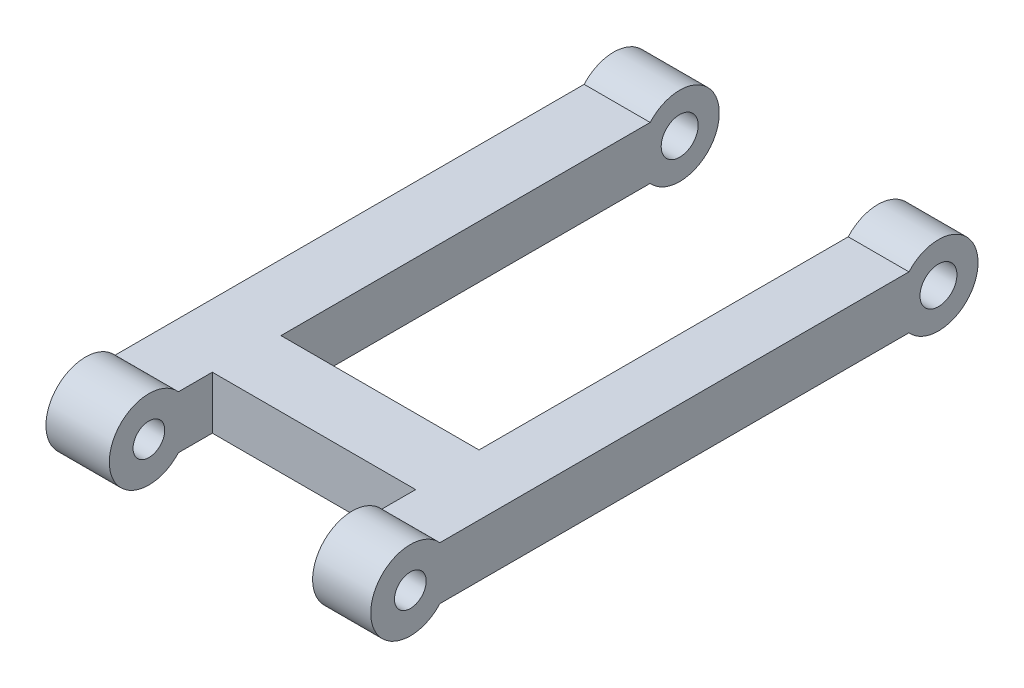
ISO-10303-21;
HEADER;
FILE_DESCRIPTION(('STEP AP214'),'2;1');
FILE_NAME('part.step','',(''),(''),'','','');
FILE_SCHEMA(('AUTOMOTIVE_DESIGN { 1 0 10303 214 1 1 1 1 }'));
ENDSEC;
DATA;
#1=APPLICATION_CONTEXT('core data for automotive mechanical design processes');
#2=APPLICATION_PROTOCOL_DEFINITION('international standard','automotive_design',2000,#1);
#3=PRODUCT_CONTEXT('',#1,'mechanical');
#4=PRODUCT('Part','Part','',(#3));
#5=PRODUCT_RELATED_PRODUCT_CATEGORY('part','',(#4));
#6=PRODUCT_DEFINITION_FORMATION('','',#4);
#7=PRODUCT_DEFINITION_CONTEXT('part definition',#1,'design');
#8=PRODUCT_DEFINITION('design','',#6,#7);
#9=PRODUCT_DEFINITION_SHAPE('','',#8);
#10=(LENGTH_UNIT() NAMED_UNIT(*) SI_UNIT(.MILLI.,.METRE.));
#11=(NAMED_UNIT(*) PLANE_ANGLE_UNIT() SI_UNIT($,.RADIAN.));
#12=(NAMED_UNIT(*) SI_UNIT($,.STERADIAN.) SOLID_ANGLE_UNIT());
#13=UNCERTAINTY_MEASURE_WITH_UNIT(LENGTH_MEASURE(1.E-05),#10,'distance_accuracy_value','');
#14=(GEOMETRIC_REPRESENTATION_CONTEXT(3) GLOBAL_UNCERTAINTY_ASSIGNED_CONTEXT((#13)) GLOBAL_UNIT_ASSIGNED_CONTEXT((#10,
#11,#12)) REPRESENTATION_CONTEXT('',''));
#15=CARTESIAN_POINT('',(0.,0.,0.));
#16=DIRECTION('',(0.,0.,1.));
#17=DIRECTION('',(1.,0.,0.));
#18=AXIS2_PLACEMENT_3D('',#15,#16,#17);
#19=CARTESIAN_POINT('',(0.,2.54,0.));
#20=DIRECTION('',(1.,0.,0.));
#21=DIRECTION('',(0.,0.,-1.));
#22=AXIS2_PLACEMENT_3D('',#19,#20,#21);
#23=CYLINDRICAL_SURFACE('',#22,3.81);
#24=CARTESIAN_POINT('',(6.096,2.54,0.));
#25=DIRECTION('',(-1.,0.,0.));
#26=DIRECTION('',(0.,0.,1.));
#27=AXIS2_PLACEMENT_3D('',#24,#25,#26);
#28=CIRCLE('',#27,3.81);
#29=CARTESIAN_POINT('',(6.096,5.08,-2.83980633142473));
#30=VERTEX_POINT('',#29);
#31=CARTESIAN_POINT('',(6.096,0.,-2.83980633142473));
#32=VERTEX_POINT('',#31);
#33=EDGE_CURVE('E192',#30,#32,#28,.F.);
#34=ORIENTED_EDGE('',*,*,#33,.F.);
#35=DIRECTION('',(1.,0.,0.));
#36=VECTOR('',#35,1.);
#37=CARTESIAN_POINT('',(0.,5.08,-2.83980633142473));
#38=LINE('',#37,#36);
#39=CARTESIAN_POINT('',(0.,5.08,-2.83980633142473));
#40=VERTEX_POINT('',#39);
#41=EDGE_CURVE('E175',#40,#30,#38,.T.);
#42=ORIENTED_EDGE('',*,*,#41,.F.);
#43=CARTESIAN_POINT('',(0.,2.54,0.));
#44=DIRECTION('',(1.,0.,0.));
#45=DIRECTION('',(0.,0.,-1.));
#46=AXIS2_PLACEMENT_3D('',#43,#44,#45);
#47=CIRCLE('',#46,3.81);
#48=CARTESIAN_POINT('',(0.,0.,-2.83980633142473));
#49=VERTEX_POINT('',#48);
#50=EDGE_CURVE('E170',#40,#49,#47,.T.);
#51=ORIENTED_EDGE('',*,*,#50,.T.);
#52=DIRECTION('',(1.,0.,0.));
#53=VECTOR('',#52,1.);
#54=CARTESIAN_POINT('',(0.,0.,-2.83980633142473));
#55=LINE('',#54,#53);
#56=EDGE_CURVE('E178',#32,#49,#55,.F.);
#57=ORIENTED_EDGE('',*,*,#56,.F.);
#58=EDGE_LOOP('',(#34,#42,#51,#57));
#59=FACE_BOUND('',#58,.T.);
#60=ADVANCED_FACE('F33',(#59),#23,.T.);
#61=CARTESIAN_POINT('',(0.,2.54,-50.8));
#62=DIRECTION('',(1.,0.,0.));
#63=DIRECTION('',(0.,0.,-1.));
#64=AXIS2_PLACEMENT_3D('',#61,#62,#63);
#65=CYLINDRICAL_SURFACE('',#64,3.81);
#66=CARTESIAN_POINT('',(25.4,2.54,-50.8));
#67=DIRECTION('',(1.,0.,0.));
#68=DIRECTION('',(0.,0.,-1.));
#69=AXIS2_PLACEMENT_3D('',#66,#67,#68);
#70=CIRCLE('',#69,3.81);
#71=CARTESIAN_POINT('',(25.4,5.08,-47.9601936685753));
#72=VERTEX_POINT('',#71);
#73=CARTESIAN_POINT('',(25.4,0.,-47.9601936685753));
#74=VERTEX_POINT('',#73);
#75=EDGE_CURVE('E133',#72,#74,#70,.F.);
#76=ORIENTED_EDGE('',*,*,#75,.F.);
#77=DIRECTION('',(1.,0.,0.));
#78=VECTOR('',#77,1.);
#79=CARTESIAN_POINT('',(0.,5.08,-47.9601936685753));
#80=LINE('',#79,#78);
#81=CARTESIAN_POINT('',(31.242,5.08,-47.9601936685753));
#82=VERTEX_POINT('',#81);
#83=EDGE_CURVE('E163',#82,#72,#80,.F.);
#84=ORIENTED_EDGE('',*,*,#83,.F.);
#85=CARTESIAN_POINT('',(31.242,2.54,-50.8));
#86=DIRECTION('',(1.,0.,0.));
#87=DIRECTION('',(0.,0.,-1.));
#88=AXIS2_PLACEMENT_3D('',#85,#86,#87);
#89=CIRCLE('',#88,3.81);
#90=CARTESIAN_POINT('',(31.242,0.,-47.9601936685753));
#91=VERTEX_POINT('',#90);
#92=EDGE_CURVE('E50',#91,#82,#89,.T.);
#93=ORIENTED_EDGE('',*,*,#92,.F.);
#94=DIRECTION('',(1.,0.,0.));
#95=VECTOR('',#94,1.);
#96=CARTESIAN_POINT('',(0.,0.,-47.9601936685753));
#97=LINE('',#96,#95);
#98=EDGE_CURVE('E166',#74,#91,#97,.T.);
#99=ORIENTED_EDGE('',*,*,#98,.F.);
#100=EDGE_LOOP('',(#76,#84,#93,#99));
#101=FACE_BOUND('',#100,.T.);
#102=ADVANCED_FACE('F253',(#101),#65,.T.);
#103=CARTESIAN_POINT('',(31.242,0.,0.));
#104=DIRECTION('',(0.,1.,0.));
#105=DIRECTION('',(0.,0.,1.));
#106=AXIS2_PLACEMENT_3D('',#103,#104,#105);
#107=PLANE('',#106);
#108=CARTESIAN_POINT('',(0.,0.,-47.9601936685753));
#109=VERTEX_POINT('',#108);
#110=CARTESIAN_POINT('',(6.35,0.,-47.9601936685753));
#111=VERTEX_POINT('',#110);
#112=EDGE_CURVE('E167',#109,#111,#97,.T.);
#113=ORIENTED_EDGE('',*,*,#112,.T.);
#114=DIRECTION('',(0.,0.,1.));
#115=VECTOR('',#114,1.);
#116=CARTESIAN_POINT('',(6.35000000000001,0.,0.));
#117=LINE('',#116,#115);
#118=CARTESIAN_POINT('',(6.35000000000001,0.,-12.4494363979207));
#119=VERTEX_POINT('',#118);
#120=EDGE_CURVE('E137',#111,#119,#117,.T.);
#121=ORIENTED_EDGE('',*,*,#120,.T.);
#122=DIRECTION('',(1.,0.,0.));
#123=VECTOR('',#122,1.);
#124=CARTESIAN_POINT('',(31.242,0.,-12.4494363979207));
#125=LINE('',#124,#123);
#126=CARTESIAN_POINT('',(25.4,0.,-12.4494363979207));
#127=VERTEX_POINT('',#126);
#128=EDGE_CURVE('E143',#119,#127,#125,.T.);
#129=ORIENTED_EDGE('',*,*,#128,.T.);
#130=DIRECTION('',(0.,0.,-1.));
#131=VECTOR('',#130,1.);
#132=CARTESIAN_POINT('',(25.4,0.,0.));
#133=LINE('',#132,#131);
#134=EDGE_CURVE('E127',#127,#74,#133,.T.);
#135=ORIENTED_EDGE('',*,*,#134,.T.);
#136=ORIENTED_EDGE('',*,*,#98,.T.);
#137=DIRECTION('',(0.,0.,-1.));
#138=VECTOR('',#137,1.);
#139=CARTESIAN_POINT('',(31.242,0.,0.));
#140=LINE('',#139,#138);
#141=CARTESIAN_POINT('',(31.242,0.,-2.83980633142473));
#142=VERTEX_POINT('',#141);
#143=EDGE_CURVE('E181',#142,#91,#140,.T.);
#144=ORIENTED_EDGE('',*,*,#143,.F.);
#145=CARTESIAN_POINT('',(25.654,0.,-2.83980633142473));
#146=VERTEX_POINT('',#145);
#147=EDGE_CURVE('E58',#142,#146,#55,.F.);
#148=ORIENTED_EDGE('',*,*,#147,.T.);
#149=DIRECTION('',(0.,0.,-1.));
#150=VECTOR('',#149,1.);
#151=CARTESIAN_POINT('',(25.654,0.,0.));
#152=LINE('',#151,#150);
#153=CARTESIAN_POINT('',(25.654,0.,-6.09943639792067));
#154=VERTEX_POINT('',#153);
#155=EDGE_CURVE('E239',#146,#154,#152,.T.);
#156=ORIENTED_EDGE('',*,*,#155,.T.);
#157=DIRECTION('',(-1.,0.,0.));
#158=VECTOR('',#157,1.);
#159=CARTESIAN_POINT('',(31.242,0.,-6.09943639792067));
#160=LINE('',#159,#158);
#161=CARTESIAN_POINT('',(6.096,0.,-6.09943639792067));
#162=VERTEX_POINT('',#161);
#163=EDGE_CURVE('E151',#154,#162,#160,.T.);
#164=ORIENTED_EDGE('',*,*,#163,.T.);
#165=DIRECTION('',(0.,0.,1.));
#166=VECTOR('',#165,1.);
#167=CARTESIAN_POINT('',(6.096,0.,0.));
#168=LINE('',#167,#166);
#169=EDGE_CURVE('E236',#162,#32,#168,.T.);
#170=ORIENTED_EDGE('',*,*,#169,.T.);
#171=ORIENTED_EDGE('',*,*,#56,.T.);
#172=DIRECTION('',(0.,0.,-1.));
#173=VECTOR('',#172,1.);
#174=CARTESIAN_POINT('',(0.,0.,0.));
#175=LINE('',#174,#173);
#176=EDGE_CURVE('E180',#49,#109,#175,.T.);
#177=ORIENTED_EDGE('',*,*,#176,.T.);
#178=EDGE_LOOP('',(#113,#121,#129,#135,#136,#144,#148,#156,#164,#170,#171,#177));
#179=FACE_BOUND('',#178,.T.);
#180=ADVANCED_FACE('F35',(#179),#107,.F.);
#181=CARTESIAN_POINT('',(31.242,5.08,0.));
#182=DIRECTION('',(0.,-1.,0.));
#183=DIRECTION('',(0.,0.,-1.));
#184=AXIS2_PLACEMENT_3D('',#181,#182,#183);
#185=PLANE('',#184);
#186=DIRECTION('',(-1.,0.,0.));
#187=VECTOR('',#186,1.);
#188=CARTESIAN_POINT('',(31.242,5.08,-12.4494363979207));
#189=LINE('',#188,#187);
#190=CARTESIAN_POINT('',(25.4,5.08,-12.4494363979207));
#191=VERTEX_POINT('',#190);
#192=CARTESIAN_POINT('',(6.35000000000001,5.08,-12.4494363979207));
#193=VERTEX_POINT('',#192);
#194=EDGE_CURVE('E11',#191,#193,#189,.T.);
#195=ORIENTED_EDGE('',*,*,#194,.T.);
#196=DIRECTION('',(0.,0.,-1.));
#197=VECTOR('',#196,1.);
#198=CARTESIAN_POINT('',(6.35000000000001,5.08,0.));
#199=LINE('',#198,#197);
#200=CARTESIAN_POINT('',(6.35,5.08,-47.9601936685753));
#201=VERTEX_POINT('',#200);
#202=EDGE_CURVE('E230',#193,#201,#199,.T.);
#203=ORIENTED_EDGE('',*,*,#202,.T.);
#204=CARTESIAN_POINT('',(0.,5.08,-47.9601936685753));
#205=VERTEX_POINT('',#204);
#206=EDGE_CURVE('E161',#201,#205,#80,.F.);
#207=ORIENTED_EDGE('',*,*,#206,.T.);
#208=DIRECTION('',(0.,0.,1.));
#209=VECTOR('',#208,1.);
#210=CARTESIAN_POINT('',(0.,5.08,0.));
#211=LINE('',#210,#209);
#212=EDGE_CURVE('E184',#205,#40,#211,.T.);
#213=ORIENTED_EDGE('',*,*,#212,.T.);
#214=ORIENTED_EDGE('',*,*,#41,.T.);
#215=DIRECTION('',(0.,0.,-1.));
#216=VECTOR('',#215,1.);
#217=CARTESIAN_POINT('',(6.096,5.08,0.));
#218=LINE('',#217,#216);
#219=CARTESIAN_POINT('',(6.096,5.08,-6.09943639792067));
#220=VERTEX_POINT('',#219);
#221=EDGE_CURVE('E233',#30,#220,#218,.T.);
#222=ORIENTED_EDGE('',*,*,#221,.T.);
#223=DIRECTION('',(1.,0.,0.));
#224=VECTOR('',#223,1.);
#225=CARTESIAN_POINT('',(31.242,5.08,-6.09943639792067));
#226=LINE('',#225,#224);
#227=CARTESIAN_POINT('',(25.654,5.08,-6.09943639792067));
#228=VERTEX_POINT('',#227);
#229=EDGE_CURVE('E42',#220,#228,#226,.T.);
#230=ORIENTED_EDGE('',*,*,#229,.T.);
#231=DIRECTION('',(0.,0.,1.));
#232=VECTOR('',#231,1.);
#233=CARTESIAN_POINT('',(25.654,5.08,0.));
#234=LINE('',#233,#232);
#235=CARTESIAN_POINT('',(25.654,5.08,-2.83980633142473));
#236=VERTEX_POINT('',#235);
#237=EDGE_CURVE('E156',#228,#236,#234,.T.);
#238=ORIENTED_EDGE('',*,*,#237,.T.);
#239=CARTESIAN_POINT('',(31.242,5.08,-2.83980633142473));
#240=VERTEX_POINT('',#239);
#241=EDGE_CURVE('E173',#236,#240,#38,.T.);
#242=ORIENTED_EDGE('',*,*,#241,.T.);
#243=DIRECTION('',(0.,0.,1.));
#244=VECTOR('',#243,1.);
#245=CARTESIAN_POINT('',(31.242,5.08,0.));
#246=LINE('',#245,#244);
#247=EDGE_CURVE('E183',#82,#240,#246,.T.);
#248=ORIENTED_EDGE('',*,*,#247,.F.);
#249=ORIENTED_EDGE('',*,*,#83,.T.);
#250=DIRECTION('',(0.,0.,1.));
#251=VECTOR('',#250,1.);
#252=CARTESIAN_POINT('',(25.4,5.08,0.));
#253=LINE('',#252,#251);
#254=EDGE_CURVE('E138',#72,#191,#253,.T.);
#255=ORIENTED_EDGE('',*,*,#254,.T.);
#256=EDGE_LOOP('',(#195,#203,#207,#213,#214,#222,#230,#238,#242,#248,#249,#255));
#257=FACE_BOUND('',#256,.T.);
#258=ADVANCED_FACE('F244',(#257),#185,.F.);
#259=CARTESIAN_POINT('',(31.242,0.,0.));
#260=DIRECTION('',(-1.,0.,0.));
#261=DIRECTION('',(0.,0.,1.));
#262=AXIS2_PLACEMENT_3D('',#259,#260,#261);
#263=PLANE('',#262);
#264=CARTESIAN_POINT('',(31.242,2.54,-50.8));
#265=DIRECTION('',(-1.,0.,0.));
#266=DIRECTION('',(0.,0.,1.));
#267=AXIS2_PLACEMENT_3D('',#264,#265,#266);
#268=CIRCLE('',#267,1.778);
#269=CARTESIAN_POINT('',(31.242,2.54,-49.022));
#270=VERTEX_POINT('',#269);
#271=EDGE_CURVE('E200',#270,#270,#268,.T.);
#272=ORIENTED_EDGE('',*,*,#271,.T.);
#273=EDGE_LOOP('',(#272));
#274=FACE_BOUND('',#273,.T.);
#275=CARTESIAN_POINT('',(31.242,2.54,0.));
#276=DIRECTION('',(-1.,0.,0.));
#277=DIRECTION('',(0.,0.,1.));
#278=AXIS2_PLACEMENT_3D('',#275,#276,#277);
#279=CIRCLE('',#278,1.524);
#280=CARTESIAN_POINT('',(31.242,2.54,1.524));
#281=VERTEX_POINT('',#280);
#282=EDGE_CURVE('E211',#281,#281,#279,.T.);
#283=ORIENTED_EDGE('',*,*,#282,.T.);
#284=EDGE_LOOP('',(#283));
#285=FACE_BOUND('',#284,.T.);
#286=ORIENTED_EDGE('',*,*,#143,.T.);
#287=ORIENTED_EDGE('',*,*,#92,.T.);
#288=ORIENTED_EDGE('',*,*,#247,.T.);
#289=CARTESIAN_POINT('',(31.242,2.54,0.));
#290=DIRECTION('',(1.,0.,0.));
#291=DIRECTION('',(0.,0.,-1.));
#292=AXIS2_PLACEMENT_3D('',#289,#290,#291);
#293=CIRCLE('',#292,3.81);
#294=EDGE_CURVE('E169',#240,#142,#293,.T.);
#295=ORIENTED_EDGE('',*,*,#294,.T.);
#296=EDGE_LOOP('',(#286,#287,#288,#295));
#297=FACE_BOUND('',#296,.T.);
#298=ADVANCED_FACE('F251',(#274,#285,#297),#263,.F.);
#299=CARTESIAN_POINT('',(0.,0.,0.));
#300=DIRECTION('',(-1.,0.,0.));
#301=DIRECTION('',(0.,0.,1.));
#302=AXIS2_PLACEMENT_3D('',#299,#300,#301);
#303=PLANE('',#302);
#304=CARTESIAN_POINT('',(0.,2.54,-50.8));
#305=DIRECTION('',(-1.,0.,0.));
#306=DIRECTION('',(0.,0.,1.));
#307=AXIS2_PLACEMENT_3D('',#304,#305,#306);
#308=CIRCLE('',#307,1.778);
#309=CARTESIAN_POINT('',(0.,2.54,-49.022));
#310=VERTEX_POINT('',#309);
#311=EDGE_CURVE('E206',#310,#310,#308,.T.);
#312=ORIENTED_EDGE('',*,*,#311,.F.);
#313=EDGE_LOOP('',(#312));
#314=FACE_BOUND('',#313,.T.);
#315=CARTESIAN_POINT('',(0.,2.54,0.));
#316=DIRECTION('',(-1.,0.,0.));
#317=DIRECTION('',(0.,0.,1.));
#318=AXIS2_PLACEMENT_3D('',#315,#316,#317);
#319=CIRCLE('',#318,1.524);
#320=CARTESIAN_POINT('',(0.,2.54,1.524));
#321=VERTEX_POINT('',#320);
#322=EDGE_CURVE('E216',#321,#321,#319,.T.);
#323=ORIENTED_EDGE('',*,*,#322,.F.);
#324=EDGE_LOOP('',(#323));
#325=FACE_BOUND('',#324,.T.);
#326=ORIENTED_EDGE('',*,*,#212,.F.);
#327=CARTESIAN_POINT('',(0.,2.54,-50.8));
#328=DIRECTION('',(1.,0.,0.));
#329=DIRECTION('',(0.,0.,-1.));
#330=AXIS2_PLACEMENT_3D('',#327,#328,#329);
#331=CIRCLE('',#330,3.81);
#332=EDGE_CURVE('E153',#109,#205,#331,.T.);
#333=ORIENTED_EDGE('',*,*,#332,.F.);
#334=ORIENTED_EDGE('',*,*,#176,.F.);
#335=ORIENTED_EDGE('',*,*,#50,.F.);
#336=EDGE_LOOP('',(#326,#333,#334,#335));
#337=FACE_BOUND('',#336,.T.);
#338=ADVANCED_FACE('F263',(#314,#325,#337),#303,.T.);
#339=CARTESIAN_POINT('',(25.654,2.54,0.));
#340=DIRECTION('',(1.,0.,0.));
#341=DIRECTION('',(0.,0.,-1.));
#342=AXIS2_PLACEMENT_3D('',#339,#340,#341);
#343=CIRCLE('',#342,3.81);
#344=EDGE_CURVE('E194',#146,#236,#343,.F.);
#345=ORIENTED_EDGE('',*,*,#344,.F.);
#346=ORIENTED_EDGE('',*,*,#147,.F.);
#347=ORIENTED_EDGE('',*,*,#294,.F.);
#348=ORIENTED_EDGE('',*,*,#241,.F.);
#349=EDGE_LOOP('',(#345,#346,#347,#348));
#350=FACE_BOUND('',#349,.T.);
#351=ADVANCED_FACE('F248',(#350),#23,.T.);
#352=CARTESIAN_POINT('',(6.35,2.54,-50.8));
#353=DIRECTION('',(-1.,0.,0.));
#354=DIRECTION('',(0.,0.,1.));
#355=AXIS2_PLACEMENT_3D('',#352,#353,#354);
#356=CIRCLE('',#355,3.81);
#357=EDGE_CURVE('E190',#111,#201,#356,.F.);
#358=ORIENTED_EDGE('',*,*,#357,.F.);
#359=ORIENTED_EDGE('',*,*,#112,.F.);
#360=ORIENTED_EDGE('',*,*,#332,.T.);
#361=ORIENTED_EDGE('',*,*,#206,.F.);
#362=EDGE_LOOP('',(#358,#359,#360,#361));
#363=FACE_BOUND('',#362,.T.);
#364=ADVANCED_FACE('F257',(#363),#65,.T.);
#365=CARTESIAN_POINT('',(25.4,-1.27,-12.4494363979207));
#366=DIRECTION('',(0.,0.,1.));
#367=DIRECTION('',(1.,0.,0.));
#368=AXIS2_PLACEMENT_3D('',#365,#366,#367);
#369=PLANE('',#368);
#370=DIRECTION('',(0.,1.,0.));
#371=VECTOR('',#370,1.);
#372=CARTESIAN_POINT('',(6.35000000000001,-1.27,-12.4494363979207));
#373=LINE('',#372,#371);
#374=EDGE_CURVE('E145',#119,#193,#373,.T.);
#375=ORIENTED_EDGE('',*,*,#374,.T.);
#376=ORIENTED_EDGE('',*,*,#194,.F.);
#377=DIRECTION('',(0.,1.,0.));
#378=VECTOR('',#377,1.);
#379=CARTESIAN_POINT('',(25.4,-1.27,-12.4494363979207));
#380=LINE('',#379,#378);
#381=EDGE_CURVE('E131',#127,#191,#380,.T.);
#382=ORIENTED_EDGE('',*,*,#381,.F.);
#383=ORIENTED_EDGE('',*,*,#128,.F.);
#384=EDGE_LOOP('',(#375,#376,#382,#383));
#385=FACE_BOUND('',#384,.T.);
#386=ADVANCED_FACE('F142',(#385),#369,.F.);
#387=CARTESIAN_POINT('',(6.35000000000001,-1.27,-12.4494363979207));
#388=DIRECTION('',(-1.,0.,0.));
#389=DIRECTION('',(0.,0.,1.));
#390=AXIS2_PLACEMENT_3D('',#387,#388,#389);
#391=PLANE('',#390);
#392=CARTESIAN_POINT('',(6.34999999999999,2.54,-50.8));
#393=DIRECTION('',(-1.,0.,0.));
#394=DIRECTION('',(0.,0.,1.));
#395=AXIS2_PLACEMENT_3D('',#392,#393,#394);
#396=CIRCLE('',#395,1.778);
#397=CARTESIAN_POINT('',(6.35,2.54,-49.022));
#398=VERTEX_POINT('',#397);
#399=EDGE_CURVE('E219',#398,#398,#396,.T.);
#400=ORIENTED_EDGE('',*,*,#399,.T.);
#401=EDGE_LOOP('',(#400));
#402=FACE_BOUND('',#401,.T.);
#403=ORIENTED_EDGE('',*,*,#374,.F.);
#404=ORIENTED_EDGE('',*,*,#120,.F.);
#405=ORIENTED_EDGE('',*,*,#357,.T.);
#406=ORIENTED_EDGE('',*,*,#202,.F.);
#407=EDGE_LOOP('',(#403,#404,#405,#406));
#408=FACE_BOUND('',#407,.T.);
#409=ADVANCED_FACE('F328',(#402,#408),#391,.F.);
#410=CARTESIAN_POINT('',(25.4,-1.27,-57.9100704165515));
#411=DIRECTION('',(1.,0.,0.));
#412=DIRECTION('',(0.,0.,-1.));
#413=AXIS2_PLACEMENT_3D('',#410,#411,#412);
#414=PLANE('',#413);
#415=CARTESIAN_POINT('',(25.4,2.54,-50.8));
#416=DIRECTION('',(1.,0.,0.));
#417=DIRECTION('',(0.,0.,-1.));
#418=AXIS2_PLACEMENT_3D('',#415,#416,#417);
#419=CIRCLE('',#418,1.778);
#420=CARTESIAN_POINT('',(25.4,2.54,-49.022));
#421=VERTEX_POINT('',#420);
#422=EDGE_CURVE('E37',#421,#421,#419,.T.);
#423=ORIENTED_EDGE('',*,*,#422,.T.);
#424=EDGE_LOOP('',(#423));
#425=FACE_BOUND('',#424,.T.);
#426=ORIENTED_EDGE('',*,*,#381,.T.);
#427=ORIENTED_EDGE('',*,*,#254,.F.);
#428=ORIENTED_EDGE('',*,*,#75,.T.);
#429=ORIENTED_EDGE('',*,*,#134,.F.);
#430=EDGE_LOOP('',(#426,#427,#428,#429));
#431=FACE_BOUND('',#430,.T.);
#432=ADVANCED_FACE('F129',(#425,#431),#414,.F.);
#433=CARTESIAN_POINT('',(6.096,-1.27,-6.09943639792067));
#434=DIRECTION('',(0.,0.,-1.));
#435=DIRECTION('',(-1.,0.,0.));
#436=AXIS2_PLACEMENT_3D('',#433,#434,#435);
#437=PLANE('',#436);
#438=DIRECTION('',(0.,1.,0.));
#439=VECTOR('',#438,1.);
#440=CARTESIAN_POINT('',(25.654,-1.27,-6.09943639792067));
#441=LINE('',#440,#439);
#442=EDGE_CURVE('E222',#154,#228,#441,.T.);
#443=ORIENTED_EDGE('',*,*,#442,.T.);
#444=ORIENTED_EDGE('',*,*,#229,.F.);
#445=DIRECTION('',(0.,1.,0.));
#446=VECTOR('',#445,1.);
#447=CARTESIAN_POINT('',(6.096,-1.27,-6.09943639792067));
#448=LINE('',#447,#446);
#449=EDGE_CURVE('E146',#162,#220,#448,.T.);
#450=ORIENTED_EDGE('',*,*,#449,.F.);
#451=ORIENTED_EDGE('',*,*,#163,.F.);
#452=EDGE_LOOP('',(#443,#444,#450,#451));
#453=FACE_BOUND('',#452,.T.);
#454=ADVANCED_FACE('F272',(#453),#437,.F.);
#455=CARTESIAN_POINT('',(25.654,-1.27,-6.09943639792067));
#456=DIRECTION('',(1.,0.,0.));
#457=DIRECTION('',(0.,0.,-1.));
#458=AXIS2_PLACEMENT_3D('',#455,#456,#457);
#459=PLANE('',#458);
#460=CARTESIAN_POINT('',(25.654,2.54,0.));
#461=DIRECTION('',(1.,0.,0.));
#462=DIRECTION('',(0.,0.,-1.));
#463=AXIS2_PLACEMENT_3D('',#460,#461,#462);
#464=CIRCLE('',#463,1.524);
#465=CARTESIAN_POINT('',(25.654,2.54,1.524));
#466=VERTEX_POINT('',#465);
#467=EDGE_CURVE('E199',#466,#466,#464,.T.);
#468=ORIENTED_EDGE('',*,*,#467,.T.);
#469=EDGE_LOOP('',(#468));
#470=FACE_BOUND('',#469,.T.);
#471=ORIENTED_EDGE('',*,*,#442,.F.);
#472=ORIENTED_EDGE('',*,*,#155,.F.);
#473=ORIENTED_EDGE('',*,*,#344,.T.);
#474=ORIENTED_EDGE('',*,*,#237,.F.);
#475=EDGE_LOOP('',(#471,#472,#473,#474));
#476=FACE_BOUND('',#475,.T.);
#477=ADVANCED_FACE('F273',(#470,#476),#459,.F.);
#478=CARTESIAN_POINT('',(6.096,-1.27,-6.09943639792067));
#479=DIRECTION('',(-1.,0.,0.));
#480=DIRECTION('',(0.,0.,1.));
#481=AXIS2_PLACEMENT_3D('',#478,#479,#480);
#482=PLANE('',#481);
#483=CARTESIAN_POINT('',(6.096,2.54,0.));
#484=DIRECTION('',(-1.,0.,0.));
#485=DIRECTION('',(0.,0.,1.));
#486=AXIS2_PLACEMENT_3D('',#483,#484,#485);
#487=CIRCLE('',#486,1.524);
#488=CARTESIAN_POINT('',(6.096,2.54,1.524));
#489=VERTEX_POINT('',#488);
#490=EDGE_CURVE('E197',#489,#489,#487,.T.);
#491=ORIENTED_EDGE('',*,*,#490,.T.);
#492=EDGE_LOOP('',(#491));
#493=FACE_BOUND('',#492,.T.);
#494=ORIENTED_EDGE('',*,*,#449,.T.);
#495=ORIENTED_EDGE('',*,*,#221,.F.);
#496=ORIENTED_EDGE('',*,*,#33,.T.);
#497=ORIENTED_EDGE('',*,*,#169,.F.);
#498=EDGE_LOOP('',(#494,#495,#496,#497));
#499=FACE_BOUND('',#498,.T.);
#500=ADVANCED_FACE('F269',(#493,#499),#482,.F.);
#501=CARTESIAN_POINT('',(31.242,2.54,0.));
#502=DIRECTION('',(-1.,0.,0.));
#503=DIRECTION('',(0.,0.,1.));
#504=AXIS2_PLACEMENT_3D('',#501,#502,#503);
#505=CYLINDRICAL_SURFACE('',#504,1.524);
#506=CARTESIAN_POINT('',(0.,2.54,1.524));
#507=CARTESIAN_POINT('',(0.0635000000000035,2.54,1.524));
#508=CARTESIAN_POINT('',(0.127000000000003,2.54,1.524));
#509=CARTESIAN_POINT('',(0.254000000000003,2.54,1.524));
#510=CARTESIAN_POINT('',(0.317500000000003,2.54,1.524));
#511=CARTESIAN_POINT('',(0.444500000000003,2.54,1.524));
#512=CARTESIAN_POINT('',(0.508000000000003,2.54,1.524));
#513=CARTESIAN_POINT('',(0.635000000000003,2.54,1.524));
#514=CARTESIAN_POINT('',(0.698500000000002,2.54,1.524));
#515=CARTESIAN_POINT('',(0.825500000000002,2.54,1.524));
#516=CARTESIAN_POINT('',(0.889000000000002,2.54,1.524));
#517=CARTESIAN_POINT('',(1.016,2.54,1.524));
#518=CARTESIAN_POINT('',(1.0795,2.54,1.524));
#519=CARTESIAN_POINT('',(1.2065,2.54,1.524));
#520=CARTESIAN_POINT('',(1.27,2.54,1.524));
#521=CARTESIAN_POINT('',(1.397,2.54,1.524));
#522=CARTESIAN_POINT('',(1.4605,2.54,1.524));
#523=CARTESIAN_POINT('',(1.5875,2.54,1.524));
#524=CARTESIAN_POINT('',(1.651,2.54,1.524));
#525=CARTESIAN_POINT('',(1.778,2.54,1.524));
#526=CARTESIAN_POINT('',(1.8415,2.54,1.524));
#527=CARTESIAN_POINT('',(1.9685,2.54,1.524));
#528=CARTESIAN_POINT('',(2.032,2.54,1.524));
#529=CARTESIAN_POINT('',(2.159,2.54,1.524));
#530=CARTESIAN_POINT('',(2.2225,2.54,1.524));
#531=CARTESIAN_POINT('',(2.3495,2.54,1.524));
#532=CARTESIAN_POINT('',(2.413,2.54,1.524));
#533=CARTESIAN_POINT('',(2.54,2.54,1.524));
#534=CARTESIAN_POINT('',(2.6035,2.54,1.524));
#535=CARTESIAN_POINT('',(2.7305,2.54,1.524));
#536=CARTESIAN_POINT('',(2.794,2.54,1.524));
#537=CARTESIAN_POINT('',(2.921,2.54,1.524));
#538=CARTESIAN_POINT('',(2.9845,2.54,1.524));
#539=CARTESIAN_POINT('',(3.1115,2.54,1.524));
#540=CARTESIAN_POINT('',(3.175,2.54,1.524));
#541=CARTESIAN_POINT('',(3.302,2.54,1.524));
#542=CARTESIAN_POINT('',(3.3655,2.54,1.524));
#543=CARTESIAN_POINT('',(3.4925,2.54,1.524));
#544=CARTESIAN_POINT('',(3.556,2.54,1.524));
#545=CARTESIAN_POINT('',(3.683,2.54,1.524));
#546=CARTESIAN_POINT('',(3.7465,2.54,1.524));
#547=CARTESIAN_POINT('',(3.8735,2.54,1.524));
#548=CARTESIAN_POINT('',(3.937,2.54,1.524));
#549=CARTESIAN_POINT('',(4.064,2.54,1.524));
#550=CARTESIAN_POINT('',(4.1275,2.54,1.524));
#551=CARTESIAN_POINT('',(4.2545,2.54,1.524));
#552=CARTESIAN_POINT('',(4.318,2.54,1.524));
#553=CARTESIAN_POINT('',(4.445,2.54,1.524));
#554=CARTESIAN_POINT('',(4.5085,2.54,1.524));
#555=CARTESIAN_POINT('',(4.6355,2.54,1.524));
#556=CARTESIAN_POINT('',(4.699,2.54,1.524));
#557=CARTESIAN_POINT('',(4.826,2.54,1.524));
#558=CARTESIAN_POINT('',(4.8895,2.54,1.524));
#559=CARTESIAN_POINT('',(5.0165,2.54,1.524));
#560=CARTESIAN_POINT('',(5.08,2.54,1.524));
#561=CARTESIAN_POINT('',(5.207,2.54,1.524));
#562=CARTESIAN_POINT('',(5.2705,2.54,1.524));
#563=CARTESIAN_POINT('',(5.3975,2.54,1.524));
#564=CARTESIAN_POINT('',(5.461,2.54,1.524));
#565=CARTESIAN_POINT('',(5.588,2.54,1.524));
#566=CARTESIAN_POINT('',(5.6515,2.54,1.524));
#567=CARTESIAN_POINT('',(5.7785,2.54,1.524));
#568=CARTESIAN_POINT('',(5.842,2.54,1.524));
#569=CARTESIAN_POINT('',(5.969,2.54,1.524));
#570=CARTESIAN_POINT('',(6.0325,2.54,1.524));
#571=CARTESIAN_POINT('',(6.096,2.54,1.524));
#572=B_SPLINE_CURVE_WITH_KNOTS('',3,(#506,#507,#508,#509,#510,#511,#512,#513,#514,#515,#516,
#517,#518,#519,#520,#521,#522,#523,#524,#525,#526,#527,#528,#529,#530,#531,#532,#533,#534,#535,
#536,#537,#538,#539,#540,#541,#542,#543,#544,#545,#546,#547,#548,#549,#550,#551,#552,#553,#554,
#555,#556,#557,#558,#559,#560,#561,#562,#563,#564,#565,#566,#567,#568,#569,#570,#571),
.UNSPECIFIED.,.F.,.F.,(4,2,2,2,2,2,2,2,2,2,2,2,2,2,2,2,2,2,2,2,2,2,2,2,2,2,2,2,2,2,2,2,4),(0.,
0.1905,0.380999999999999,0.571499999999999,0.761999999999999,0.952499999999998,1.143,1.3335,
1.524,1.7145,1.905,2.0955,2.286,2.4765,2.667,2.8575,3.048,3.2385,3.429,3.6195,3.81,4.0005,4.191,
4.3815,4.572,4.7625,4.953,5.1435,5.334,5.5245,5.715,5.9055,6.096),.UNSPECIFIED.);
#573=EDGE_CURVE('BSEAM281',#321,#489,#572,.T.);
#574=ORIENTED_EDGE('',*,*,#322,.T.);
#575=ORIENTED_EDGE('',*,*,#490,.F.);
#576=ORIENTED_EDGE('',*,*,#573,.T.);
#577=ORIENTED_EDGE('',*,*,#573,.F.);
#578=EDGE_LOOP('',(#574,#576,#575,#577));
#579=FACE_BOUND('',#578,.T.);
#580=ADVANCED_FACE('F281',(#579),#505,.F.);
#581=CARTESIAN_POINT('',(31.242,2.54,1.524));
#582=CARTESIAN_POINT('',(31.1837916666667,2.54,1.524));
#583=CARTESIAN_POINT('',(31.1255833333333,2.54,1.524));
#584=CARTESIAN_POINT('',(31.0091666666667,2.54,1.524));
#585=CARTESIAN_POINT('',(30.9509583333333,2.54,1.524));
#586=CARTESIAN_POINT('',(30.8345416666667,2.54,1.524));
#587=CARTESIAN_POINT('',(30.7763333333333,2.54,1.524));
#588=CARTESIAN_POINT('',(30.6599166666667,2.54,1.524));
#589=CARTESIAN_POINT('',(30.6017083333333,2.54,1.524));
#590=CARTESIAN_POINT('',(30.4852916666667,2.54,1.524));
#591=CARTESIAN_POINT('',(30.4270833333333,2.54,1.524));
#592=CARTESIAN_POINT('',(30.3106666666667,2.54,1.524));
#593=CARTESIAN_POINT('',(30.2524583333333,2.54,1.524));
#594=CARTESIAN_POINT('',(30.1360416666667,2.54,1.524));
#595=CARTESIAN_POINT('',(30.0778333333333,2.54,1.524));
#596=CARTESIAN_POINT('',(29.9614166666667,2.54,1.524));
#597=CARTESIAN_POINT('',(29.9032083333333,2.54,1.524));
#598=CARTESIAN_POINT('',(29.7867916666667,2.54,1.524));
#599=CARTESIAN_POINT('',(29.7285833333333,2.54,1.524));
#600=CARTESIAN_POINT('',(29.6121666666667,2.54,1.524));
#601=CARTESIAN_POINT('',(29.5539583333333,2.54,1.524));
#602=CARTESIAN_POINT('',(29.4375416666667,2.54,1.524));
#603=CARTESIAN_POINT('',(29.3793333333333,2.54,1.524));
#604=CARTESIAN_POINT('',(29.2629166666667,2.54,1.524));
#605=CARTESIAN_POINT('',(29.2047083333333,2.54,1.524));
#606=CARTESIAN_POINT('',(29.0882916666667,2.54,1.524));
#607=CARTESIAN_POINT('',(29.0300833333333,2.54,1.524));
#608=CARTESIAN_POINT('',(28.9136666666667,2.54,1.524));
#609=CARTESIAN_POINT('',(28.8554583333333,2.54,1.524));
#610=CARTESIAN_POINT('',(28.7390416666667,2.54,1.524));
#611=CARTESIAN_POINT('',(28.6808333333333,2.54,1.524));
#612=CARTESIAN_POINT('',(28.5644166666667,2.54,1.524));
#613=CARTESIAN_POINT('',(28.5062083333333,2.54,1.524));
#614=CARTESIAN_POINT('',(28.3897916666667,2.54,1.524));
#615=CARTESIAN_POINT('',(28.3315833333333,2.54,1.524));
#616=CARTESIAN_POINT('',(28.2151666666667,2.54,1.524));
#617=CARTESIAN_POINT('',(28.1569583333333,2.54,1.524));
#618=CARTESIAN_POINT('',(28.0405416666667,2.54,1.524));
#619=CARTESIAN_POINT('',(27.9823333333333,2.54,1.524));
#620=CARTESIAN_POINT('',(27.8659166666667,2.54,1.524));
#621=CARTESIAN_POINT('',(27.8077083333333,2.54,1.524));
#622=CARTESIAN_POINT('',(27.6912916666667,2.54,1.524));
#623=CARTESIAN_POINT('',(27.6330833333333,2.54,1.524));
#624=CARTESIAN_POINT('',(27.5166666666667,2.54,1.524));
#625=CARTESIAN_POINT('',(27.4584583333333,2.54,1.524));
#626=CARTESIAN_POINT('',(27.3420416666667,2.54,1.524));
#627=CARTESIAN_POINT('',(27.2838333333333,2.54,1.524));
#628=CARTESIAN_POINT('',(27.1674166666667,2.54,1.524));
#629=CARTESIAN_POINT('',(27.1092083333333,2.54,1.524));
#630=CARTESIAN_POINT('',(26.9927916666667,2.54,1.524));
#631=CARTESIAN_POINT('',(26.9345833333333,2.54,1.524));
#632=CARTESIAN_POINT('',(26.8181666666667,2.54,1.524));
#633=CARTESIAN_POINT('',(26.7599583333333,2.54,1.524));
#634=CARTESIAN_POINT('',(26.6435416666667,2.54,1.524));
#635=CARTESIAN_POINT('',(26.5853333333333,2.54,1.524));
#636=CARTESIAN_POINT('',(26.4689166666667,2.54,1.524));
#637=CARTESIAN_POINT('',(26.4107083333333,2.54,1.524));
#638=CARTESIAN_POINT('',(26.2942916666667,2.54,1.524));
#639=CARTESIAN_POINT('',(26.2360833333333,2.54,1.524));
#640=CARTESIAN_POINT('',(26.1196666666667,2.54,1.524));
#641=CARTESIAN_POINT('',(26.0614583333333,2.54,1.524));
#642=CARTESIAN_POINT('',(25.9450416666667,2.54,1.524));
#643=CARTESIAN_POINT('',(25.8868333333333,2.54,1.524));
#644=CARTESIAN_POINT('',(25.7704166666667,2.54,1.524));
#645=CARTESIAN_POINT('',(25.7122083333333,2.54,1.524));
#646=CARTESIAN_POINT('',(25.654,2.54,1.524));
#647=B_SPLINE_CURVE_WITH_KNOTS('',3,(#581,#582,#583,#584,#585,#586,#587,#588,#589,#590,#591,
#592,#593,#594,#595,#596,#597,#598,#599,#600,#601,#602,#603,#604,#605,#606,#607,#608,#609,#610,
#611,#612,#613,#614,#615,#616,#617,#618,#619,#620,#621,#622,#623,#624,#625,#626,#627,#628,#629,
#630,#631,#632,#633,#634,#635,#636,#637,#638,#639,#640,#641,#642,#643,#644,#645,#646),
.UNSPECIFIED.,.F.,.F.,(4,2,2,2,2,2,2,2,2,2,2,2,2,2,2,2,2,2,2,2,2,2,2,2,2,2,2,2,2,2,2,2,4),(0.,
0.174625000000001,0.349250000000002,0.523875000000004,0.698500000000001,0.873125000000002,
1.04775,1.222375,1.397,1.571625,1.74625,1.920875,2.0955,2.270125,2.44475,2.619375,2.794,
2.968625,3.14325,3.317875,3.4925,3.667125,3.84175,4.016375,4.191,4.365625,4.54025,4.714875,
4.8895,5.064125,5.23875,5.413375,5.588),.UNSPECIFIED.);
#648=EDGE_CURVE('BSEAM374',#281,#466,#647,.T.);
#649=ORIENTED_EDGE('',*,*,#282,.F.);
#650=ORIENTED_EDGE('',*,*,#467,.F.);
#651=ORIENTED_EDGE('',*,*,#648,.T.);
#652=ORIENTED_EDGE('',*,*,#648,.F.);
#653=EDGE_LOOP('',(#649,#651,#650,#652));
#654=FACE_BOUND('',#653,.T.);
#655=ADVANCED_FACE('F374',(#654),#505,.F.);
#656=CARTESIAN_POINT('',(31.242,2.54,-50.8));
#657=DIRECTION('',(-1.,0.,0.));
#658=DIRECTION('',(0.,0.,1.));
#659=AXIS2_PLACEMENT_3D('',#656,#657,#658);
#660=CYLINDRICAL_SURFACE('',#659,1.778);
#661=CARTESIAN_POINT('',(31.242,2.54,-49.022));
#662=CARTESIAN_POINT('',(31.1811458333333,2.54,-49.022));
#663=CARTESIAN_POINT('',(31.1202916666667,2.54,-49.022));
#664=CARTESIAN_POINT('',(30.9985833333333,2.54,-49.022));
#665=CARTESIAN_POINT('',(30.9377291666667,2.54,-49.022));
#666=CARTESIAN_POINT('',(30.8160208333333,2.54,-49.022));
#667=CARTESIAN_POINT('',(30.7551666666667,2.54,-49.022));
#668=CARTESIAN_POINT('',(30.6334583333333,2.54,-49.022));
#669=CARTESIAN_POINT('',(30.5726041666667,2.54,-49.022));
#670=CARTESIAN_POINT('',(30.4508958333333,2.54,-49.022));
#671=CARTESIAN_POINT('',(30.3900416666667,2.54,-49.022));
#672=CARTESIAN_POINT('',(30.2683333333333,2.54,-49.022));
#673=CARTESIAN_POINT('',(30.2074791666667,2.54,-49.022));
#674=CARTESIAN_POINT('',(30.0857708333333,2.54,-49.022));
#675=CARTESIAN_POINT('',(30.0249166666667,2.54,-49.022));
#676=CARTESIAN_POINT('',(29.9032083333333,2.54,-49.022));
#677=CARTESIAN_POINT('',(29.8423541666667,2.54,-49.022));
#678=CARTESIAN_POINT('',(29.7206458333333,2.54,-49.022));
#679=CARTESIAN_POINT('',(29.6597916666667,2.54,-49.022));
#680=CARTESIAN_POINT('',(29.5380833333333,2.54,-49.022));
#681=CARTESIAN_POINT('',(29.4772291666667,2.54,-49.022));
#682=CARTESIAN_POINT('',(29.3555208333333,2.54,-49.022));
#683=CARTESIAN_POINT('',(29.2946666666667,2.54,-49.022));
#684=CARTESIAN_POINT('',(29.1729583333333,2.54,-49.022));
#685=CARTESIAN_POINT('',(29.1121041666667,2.54,-49.022));
#686=CARTESIAN_POINT('',(28.9903958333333,2.54,-49.022));
#687=CARTESIAN_POINT('',(28.9295416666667,2.54,-49.022));
#688=CARTESIAN_POINT('',(28.8078333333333,2.54,-49.022));
#689=CARTESIAN_POINT('',(28.7469791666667,2.54,-49.022));
#690=CARTESIAN_POINT('',(28.6252708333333,2.54,-49.022));
#691=CARTESIAN_POINT('',(28.5644166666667,2.54,-49.022));
#692=CARTESIAN_POINT('',(28.4427083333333,2.54,-49.022));
#693=CARTESIAN_POINT('',(28.3818541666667,2.54,-49.022));
#694=CARTESIAN_POINT('',(28.2601458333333,2.54,-49.022));
#695=CARTESIAN_POINT('',(28.1992916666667,2.54,-49.022));
#696=CARTESIAN_POINT('',(28.0775833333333,2.54,-49.022));
#697=CARTESIAN_POINT('',(28.0167291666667,2.54,-49.022));
#698=CARTESIAN_POINT('',(27.8950208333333,2.54,-49.022));
#699=CARTESIAN_POINT('',(27.8341666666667,2.54,-49.022));
#700=CARTESIAN_POINT('',(27.7124583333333,2.54,-49.022));
#701=CARTESIAN_POINT('',(27.6516041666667,2.54,-49.022));
#702=CARTESIAN_POINT('',(27.5298958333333,2.54,-49.022));
#703=CARTESIAN_POINT('',(27.4690416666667,2.54,-49.022));
#704=CARTESIAN_POINT('',(27.3473333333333,2.54,-49.022));
#705=CARTESIAN_POINT('',(27.2864791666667,2.54,-49.022));
#706=CARTESIAN_POINT('',(27.1647708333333,2.54,-49.022));
#707=CARTESIAN_POINT('',(27.1039166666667,2.54,-49.022));
#708=CARTESIAN_POINT('',(26.9822083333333,2.54,-49.022));
#709=CARTESIAN_POINT('',(26.9213541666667,2.54,-49.022));
#710=CARTESIAN_POINT('',(26.7996458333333,2.54,-49.022));
#711=CARTESIAN_POINT('',(26.7387916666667,2.54,-49.022));
#712=CARTESIAN_POINT('',(26.6170833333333,2.54,-49.022));
#713=CARTESIAN_POINT('',(26.5562291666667,2.54,-49.022));
#714=CARTESIAN_POINT('',(26.4345208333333,2.54,-49.022));
#715=CARTESIAN_POINT('',(26.3736666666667,2.54,-49.022));
#716=CARTESIAN_POINT('',(26.2519583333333,2.54,-49.022));
#717=CARTESIAN_POINT('',(26.1911041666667,2.54,-49.022));
#718=CARTESIAN_POINT('',(26.0693958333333,2.54,-49.022));
#719=CARTESIAN_POINT('',(26.0085416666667,2.54,-49.022));
#720=CARTESIAN_POINT('',(25.8868333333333,2.54,-49.022));
#721=CARTESIAN_POINT('',(25.8259791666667,2.54,-49.022));
#722=CARTESIAN_POINT('',(25.7042708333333,2.54,-49.022));
#723=CARTESIAN_POINT('',(25.6434166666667,2.54,-49.022));
#724=CARTESIAN_POINT('',(25.5217083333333,2.54,-49.022));
#725=CARTESIAN_POINT('',(25.4608541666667,2.54,-49.022));
#726=CARTESIAN_POINT('',(25.4,2.54,-49.022));
#727=B_SPLINE_CURVE_WITH_KNOTS('',3,(#661,#662,#663,#664,#665,#666,#667,#668,#669,#670,#671,
#672,#673,#674,#675,#676,#677,#678,#679,#680,#681,#682,#683,#684,#685,#686,#687,#688,#689,#690,
#691,#692,#693,#694,#695,#696,#697,#698,#699,#700,#701,#702,#703,#704,#705,#706,#707,#708,#709,
#710,#711,#712,#713,#714,#715,#716,#717,#718,#719,#720,#721,#722,#723,#724,#725,#726),
.UNSPECIFIED.,.F.,.F.,(4,2,2,2,2,2,2,2,2,2,2,2,2,2,2,2,2,2,2,2,2,2,2,2,2,2,2,2,2,2,2,2,4),(0.,
0.182562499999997,0.365124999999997,0.547687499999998,0.730249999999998,0.912812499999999,
1.095375,1.2779375,1.4605,1.6430625,1.825625,2.0081875,2.19075,2.3733125,2.555875,2.7384375,
2.921,3.1035625,3.286125,3.4686875,3.65125,3.8338125,4.016375,4.1989375,4.3815,4.5640625,
4.746625,4.9291875,5.11175,5.2943125,5.476875,5.6594375,5.842),.UNSPECIFIED.);
#728=EDGE_CURVE('BSEAM383',#270,#421,#727,.T.);
#729=ORIENTED_EDGE('',*,*,#271,.F.);
#730=ORIENTED_EDGE('',*,*,#422,.F.);
#731=ORIENTED_EDGE('',*,*,#728,.T.);
#732=ORIENTED_EDGE('',*,*,#728,.F.);
#733=EDGE_LOOP('',(#729,#731,#730,#732));
#734=FACE_BOUND('',#733,.T.);
#735=ADVANCED_FACE('F383',(#734),#660,.F.);
#736=CARTESIAN_POINT('',(0.,2.54,-49.022));
#737=CARTESIAN_POINT('',(0.0661458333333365,2.54,-49.022));
#738=CARTESIAN_POINT('',(0.132291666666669,2.54,-49.022));
#739=CARTESIAN_POINT('',(0.264583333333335,2.54,-49.022));
#740=CARTESIAN_POINT('',(0.330729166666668,2.54,-49.022));
#741=CARTESIAN_POINT('',(0.463020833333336,2.54,-49.022));
#742=CARTESIAN_POINT('',(0.52916666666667,2.54,-49.022));
#743=CARTESIAN_POINT('',(0.661458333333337,2.54,-49.022));
#744=CARTESIAN_POINT('',(0.72760416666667,2.54,-49.022));
#745=CARTESIAN_POINT('',(0.859895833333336,2.54,-49.022));
#746=CARTESIAN_POINT('',(0.926041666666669,2.54,-49.022));
#747=CARTESIAN_POINT('',(1.05833333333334,2.54,-49.022));
#748=CARTESIAN_POINT('',(1.12447916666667,2.54,-49.022));
#749=CARTESIAN_POINT('',(1.25677083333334,2.54,-49.022));
#750=CARTESIAN_POINT('',(1.32291666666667,2.54,-49.022));
#751=CARTESIAN_POINT('',(1.45520833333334,2.54,-49.022));
#752=CARTESIAN_POINT('',(1.52135416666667,2.54,-49.022));
#753=CARTESIAN_POINT('',(1.65364583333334,2.54,-49.022));
#754=CARTESIAN_POINT('',(1.71979166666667,2.54,-49.022));
#755=CARTESIAN_POINT('',(1.85208333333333,2.54,-49.022));
#756=CARTESIAN_POINT('',(1.91822916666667,2.54,-49.022));
#757=CARTESIAN_POINT('',(2.05052083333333,2.54,-49.022));
#758=CARTESIAN_POINT('',(2.11666666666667,2.54,-49.022));
#759=CARTESIAN_POINT('',(2.24895833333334,2.54,-49.022));
#760=CARTESIAN_POINT('',(2.31510416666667,2.54,-49.022));
#761=CARTESIAN_POINT('',(2.44739583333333,2.54,-49.022));
#762=CARTESIAN_POINT('',(2.51354166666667,2.54,-49.022));
#763=CARTESIAN_POINT('',(2.64583333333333,2.54,-49.022));
#764=CARTESIAN_POINT('',(2.71197916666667,2.54,-49.022));
#765=CARTESIAN_POINT('',(2.84427083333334,2.54,-49.022));
#766=CARTESIAN_POINT('',(2.91041666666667,2.54,-49.022));
#767=CARTESIAN_POINT('',(3.04270833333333,2.54,-49.022));
#768=CARTESIAN_POINT('',(3.10885416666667,2.54,-49.022));
#769=CARTESIAN_POINT('',(3.24114583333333,2.54,-49.022));
#770=CARTESIAN_POINT('',(3.30729166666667,2.54,-49.022));
#771=CARTESIAN_POINT('',(3.43958333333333,2.54,-49.022));
#772=CARTESIAN_POINT('',(3.50572916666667,2.54,-49.022));
#773=CARTESIAN_POINT('',(3.63802083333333,2.54,-49.022));
#774=CARTESIAN_POINT('',(3.70416666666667,2.54,-49.022));
#775=CARTESIAN_POINT('',(3.83645833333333,2.54,-49.022));
#776=CARTESIAN_POINT('',(3.90260416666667,2.54,-49.022));
#777=CARTESIAN_POINT('',(4.03489583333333,2.54,-49.022));
#778=CARTESIAN_POINT('',(4.10104166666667,2.54,-49.022));
#779=CARTESIAN_POINT('',(4.23333333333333,2.54,-49.022));
#780=CARTESIAN_POINT('',(4.29947916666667,2.54,-49.022));
#781=CARTESIAN_POINT('',(4.43177083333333,2.54,-49.022));
#782=CARTESIAN_POINT('',(4.49791666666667,2.54,-49.022));
#783=CARTESIAN_POINT('',(4.63020833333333,2.54,-49.022));
#784=CARTESIAN_POINT('',(4.69635416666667,2.54,-49.022));
#785=CARTESIAN_POINT('',(4.82864583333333,2.54,-49.022));
#786=CARTESIAN_POINT('',(4.89479166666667,2.54,-49.022));
#787=CARTESIAN_POINT('',(5.02708333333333,2.54,-49.022));
#788=CARTESIAN_POINT('',(5.09322916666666,2.54,-49.022));
#789=CARTESIAN_POINT('',(5.22552083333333,2.54,-49.022));
#790=CARTESIAN_POINT('',(5.29166666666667,2.54,-49.022));
#791=CARTESIAN_POINT('',(5.42395833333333,2.54,-49.022));
#792=CARTESIAN_POINT('',(5.49010416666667,2.54,-49.022));
#793=CARTESIAN_POINT('',(5.62239583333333,2.54,-49.022));
#794=CARTESIAN_POINT('',(5.68854166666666,2.54,-49.022));
#795=CARTESIAN_POINT('',(5.82083333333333,2.54,-49.022));
#796=CARTESIAN_POINT('',(5.88697916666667,2.54,-49.022));
#797=CARTESIAN_POINT('',(6.01927083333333,2.54,-49.022));
#798=CARTESIAN_POINT('',(6.08541666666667,2.54,-49.022));
#799=CARTESIAN_POINT('',(6.21770833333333,2.54,-49.022));
#800=CARTESIAN_POINT('',(6.28385416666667,2.54,-49.022));
#801=CARTESIAN_POINT('',(6.35,2.54,-49.022));
#802=B_SPLINE_CURVE_WITH_KNOTS('',3,(#736,#737,#738,#739,#740,#741,#742,#743,#744,#745,#746,
#747,#748,#749,#750,#751,#752,#753,#754,#755,#756,#757,#758,#759,#760,#761,#762,#763,#764,#765,
#766,#767,#768,#769,#770,#771,#772,#773,#774,#775,#776,#777,#778,#779,#780,#781,#782,#783,#784,
#785,#786,#787,#788,#789,#790,#791,#792,#793,#794,#795,#796,#797,#798,#799,#800,#801),
.UNSPECIFIED.,.F.,.F.,(4,2,2,2,2,2,2,2,2,2,2,2,2,2,2,2,2,2,2,2,2,2,2,2,2,2,2,2,2,2,2,2,4),(0.,
0.198437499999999,0.396874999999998,0.5953125,0.793749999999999,0.992187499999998,1.190625,
1.3890625,1.5875,1.7859375,1.984375,2.1828125,2.38125,2.5796875,2.778125,2.9765625,3.175,
3.3734375,3.571875,3.7703125,3.96875,4.1671875,4.365625,4.5640625,4.7625,4.96093749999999,
5.15937499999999,5.3578125,5.55625,5.75468749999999,5.953125,6.1515625,6.34999999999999),.UNSPECIFIED.);
#803=EDGE_CURVE('BSEAM391',#310,#398,#802,.T.);
#804=ORIENTED_EDGE('',*,*,#311,.T.);
#805=ORIENTED_EDGE('',*,*,#399,.F.);
#806=ORIENTED_EDGE('',*,*,#803,.T.);
#807=ORIENTED_EDGE('',*,*,#803,.F.);
#808=EDGE_LOOP('',(#804,#806,#805,#807));
#809=FACE_BOUND('',#808,.T.);
#810=ADVANCED_FACE('F391',(#809),#660,.F.);
#811=CLOSED_SHELL('',(#60,#102,#180,#258,#298,#338,#351,#364,#386,#409,#432,#454,#477,#500,#580,
#655,#735,#810));
#812=MANIFOLD_SOLID_BREP('B2',#811);
#813=ADVANCED_BREP_SHAPE_REPRESENTATION('',(#18,#812),#14);
#814=SHAPE_DEFINITION_REPRESENTATION(#9,#813);
ENDSEC;
END-ISO-10303-21;
